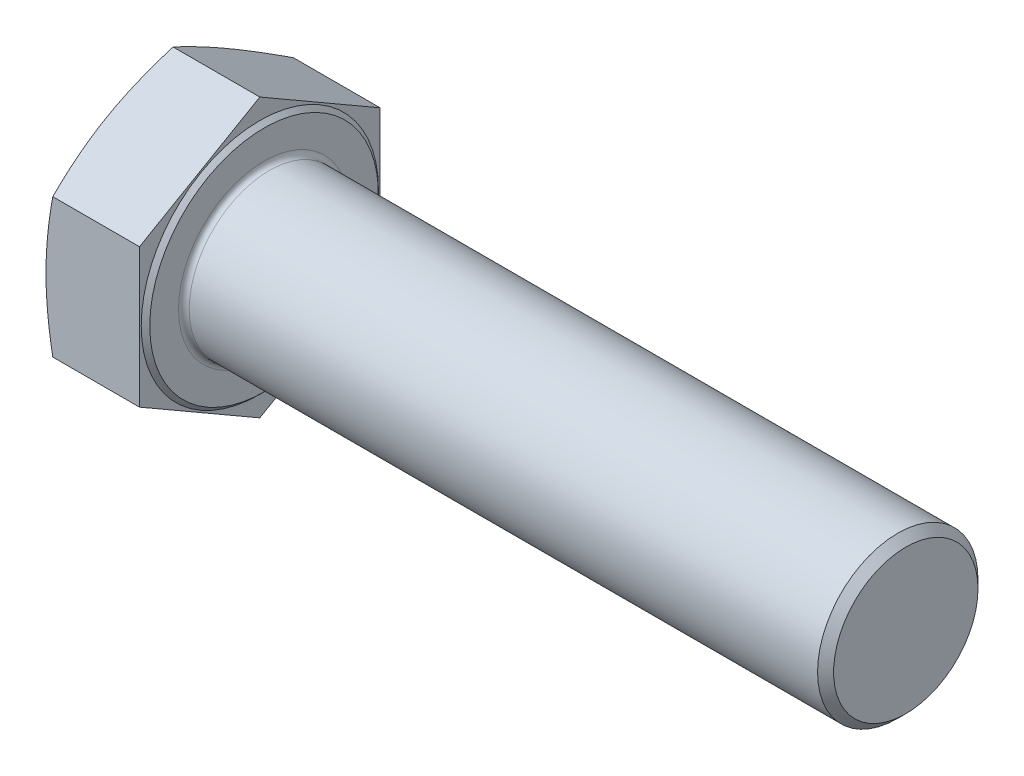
ISO-10303-21;
HEADER;
FILE_DESCRIPTION(('STEP AP214'),'2;1');
FILE_NAME('part.step','',(''),(''),'','','');
FILE_SCHEMA(('AUTOMOTIVE_DESIGN { 1 0 10303 214 1 1 1 1 }'));
ENDSEC;
DATA;
#1=APPLICATION_CONTEXT('core data for automotive mechanical design processes');
#2=APPLICATION_PROTOCOL_DEFINITION('international standard','automotive_design',2000,#1);
#3=PRODUCT_CONTEXT('',#1,'mechanical');
#4=PRODUCT('Part','Part','',(#3));
#5=PRODUCT_RELATED_PRODUCT_CATEGORY('part','',(#4));
#6=PRODUCT_DEFINITION_FORMATION('','',#4);
#7=PRODUCT_DEFINITION_CONTEXT('part definition',#1,'design');
#8=PRODUCT_DEFINITION('design','',#6,#7);
#9=PRODUCT_DEFINITION_SHAPE('','',#8);
#10=(LENGTH_UNIT() NAMED_UNIT(*) SI_UNIT(.MILLI.,.METRE.));
#11=(NAMED_UNIT(*) PLANE_ANGLE_UNIT() SI_UNIT($,.RADIAN.));
#12=(NAMED_UNIT(*) SI_UNIT($,.STERADIAN.) SOLID_ANGLE_UNIT());
#13=UNCERTAINTY_MEASURE_WITH_UNIT(LENGTH_MEASURE(1.E-05),#10,'distance_accuracy_value','');
#14=(GEOMETRIC_REPRESENTATION_CONTEXT(3) GLOBAL_UNCERTAINTY_ASSIGNED_CONTEXT((#13)) GLOBAL_UNIT_ASSIGNED_CONTEXT((#10,
#11,#12)) REPRESENTATION_CONTEXT('',''));
#15=CARTESIAN_POINT('',(0.,0.,0.));
#16=DIRECTION('',(0.,0.,1.));
#17=DIRECTION('',(1.,0.,0.));
#18=AXIS2_PLACEMENT_3D('',#15,#16,#17);
#19=CARTESIAN_POINT('',(18.28,0.,45.));
#20=DIRECTION('',(-1.,0.,0.));
#21=DIRECTION('',(0.,0.,1.));
#22=AXIS2_PLACEMENT_3D('',#19,#20,#21);
#23=PLANE('',#22);
#24=CARTESIAN_POINT('',(18.28,0.,0.));
#25=DIRECTION('',(-1.,0.,0.));
#26=DIRECTION('',(0.,0.,1.));
#27=AXIS2_PLACEMENT_3D('',#24,#25,#26);
#28=CIRCLE('',#27,16.);
#29=CARTESIAN_POINT('',(18.28,0.,16.));
#30=VERTEX_POINT('',#29);
#31=EDGE_CURVE('E11',#30,#30,#28,.T.);
#32=ORIENTED_EDGE('',*,*,#31,.T.);
#33=EDGE_LOOP('',(#32));
#34=FACE_BOUND('',#33,.T.);
#35=CARTESIAN_POINT('',(18.28,0.,0.));
#36=DIRECTION('',(-1.,0.,0.));
#37=DIRECTION('',(0.,0.,1.));
#38=AXIS2_PLACEMENT_3D('',#35,#36,#37);
#39=CIRCLE('',#38,21.375);
#40=CARTESIAN_POINT('',(18.28,0.,21.375));
#41=VERTEX_POINT('',#40);
#42=EDGE_CURVE('E265',#41,#41,#39,.T.);
#43=ORIENTED_EDGE('',*,*,#42,.F.);
#44=EDGE_LOOP('',(#43));
#45=FACE_BOUND('',#44,.T.);
#46=ADVANCED_FACE('F32',(#34,#45),#23,.F.);
#47=CARTESIAN_POINT('',(18.28,-12.9903810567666,22.5));
#48=DIRECTION('',(0.,0.866025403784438,-0.5));
#49=DIRECTION('',(0.,0.5,0.866025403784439));
#50=AXIS2_PLACEMENT_3D('',#47,#48,#49);
#51=PLANE('',#50);
#52=CARTESIAN_POINT('',(1.26693582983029,-25.980877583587,-0.000199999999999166));
#53=CARTESIAN_POINT('',(1.16902690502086,-25.7118550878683,0.46576063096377));
#54=CARTESIAN_POINT('',(1.07552121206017,-25.4424372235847,0.932406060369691));
#55=CARTESIAN_POINT('',(0.89828493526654,-24.9027740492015,1.86713009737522));
#56=CARTESIAN_POINT('',(0.814555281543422,-24.6325286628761,2.33520883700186));
#57=CARTESIAN_POINT('',(0.579402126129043,-23.8201988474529,3.74220534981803));
#58=CARTESIAN_POINT('',(0.444152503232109,-23.2768926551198,4.68323927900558));
#59=CARTESIAN_POINT('',(0.279780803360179,-22.4626151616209,6.09360926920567));
#60=CARTESIAN_POINT('',(0.231546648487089,-22.1925833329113,6.56131811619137));
#61=CARTESIAN_POINT('',(0.148249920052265,-21.6520154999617,7.49760906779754));
#62=CARTESIAN_POINT('',(0.113186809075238,-21.3814795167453,7.96619113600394));
#63=CARTESIAN_POINT('',(0.0568446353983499,-20.8401411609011,8.90381667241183));
#64=CARTESIAN_POINT('',(0.0355608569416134,-20.569338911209,9.37285992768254));
#65=CARTESIAN_POINT('',(0.00713856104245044,-20.0275483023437,10.3112687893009));
#66=CARTESIAN_POINT('',(0.,-19.7565599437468,10.7806343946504));
#67=CARTESIAN_POINT('',(0.,-19.2145832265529,11.7193656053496));
#68=CARTESIAN_POINT('',(0.0071385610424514,-18.943594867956,12.1887312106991));
#69=CARTESIAN_POINT('',(0.0355608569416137,-18.4018042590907,13.1271400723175));
#70=CARTESIAN_POINT('',(0.0568446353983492,-18.1310020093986,13.5961833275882));
#71=CARTESIAN_POINT('',(0.113186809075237,-17.5896636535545,14.5338088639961));
#72=CARTESIAN_POINT('',(0.148249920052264,-17.3191276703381,15.0023909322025));
#73=CARTESIAN_POINT('',(0.231546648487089,-16.7785598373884,15.9386818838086));
#74=CARTESIAN_POINT('',(0.279780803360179,-16.5085280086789,16.4063907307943));
#75=CARTESIAN_POINT('',(0.444152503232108,-15.6942505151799,17.8167607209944));
#76=CARTESIAN_POINT('',(0.579402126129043,-15.1509443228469,18.757794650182));
#77=CARTESIAN_POINT('',(0.814555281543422,-14.3386145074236,20.1647911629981));
#78=CARTESIAN_POINT('',(0.89828493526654,-14.0683691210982,20.6328699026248));
#79=CARTESIAN_POINT('',(1.07552121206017,-13.528705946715,21.5675939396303));
#80=CARTESIAN_POINT('',(1.16902690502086,-13.2592880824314,22.0342393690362));
#81=CARTESIAN_POINT('',(1.26693582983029,-12.9902655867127,22.5002));
#82=B_SPLINE_CURVE_WITH_KNOTS('',3,(#52,#53,#54,#55,#56,#57,#58,#59,#60,#61,#62,#63,#64,#65,#66,
#67,#68,#69,#70,#71,#72,#73,#74,#75,#76,#77,#78,#79,#80,#81),.UNSPECIFIED.,.F.,.F.,(4,2,2,2,2,2,
2,2,2,2,2,2,2,2,4),(0.,1.64059355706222,3.28134307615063,6.56511024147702,8.19162193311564,
9.81806725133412,11.4439556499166,13.0698390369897,14.6957224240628,16.3216108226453,
17.9480561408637,19.5745678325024,22.8583349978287,24.4990845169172,26.1396780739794),.UNSPECIFIED.);
#83=CARTESIAN_POINT('',(1.26689380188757,-25.9807621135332,0.));
#84=VERTEX_POINT('',#83);
#85=CARTESIAN_POINT('',(0.,-19.4855715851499,11.25));
#86=VERTEX_POINT('',#85);
#87=EDGE_CURVE('E279',#84,#86,#82,.T.);
#88=ORIENTED_EDGE('',*,*,#87,.F.);
#89=DIRECTION('',(-1.,0.,0.));
#90=VECTOR('',#89,1.);
#91=CARTESIAN_POINT('',(18.28,-25.9807621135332,0.));
#92=LINE('',#91,#90);
#93=CARTESIAN_POINT('',(17.48,-25.9807621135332,0.));
#94=VERTEX_POINT('',#93);
#95=EDGE_CURVE('E144',#94,#84,#92,.T.);
#96=ORIENTED_EDGE('',*,*,#95,.F.);
#97=DIRECTION('',(0.,-0.5,-0.866025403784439));
#98=VECTOR('',#97,1.);
#99=CARTESIAN_POINT('',(17.48,-12.9903810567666,22.5));
#100=LINE('',#99,#98);
#101=CARTESIAN_POINT('',(17.48,-12.9903810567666,22.5));
#102=VERTEX_POINT('',#101);
#103=EDGE_CURVE('E135',#102,#94,#100,.T.);
#104=ORIENTED_EDGE('',*,*,#103,.F.);
#105=DIRECTION('',(-1.,0.,0.));
#106=VECTOR('',#105,1.);
#107=CARTESIAN_POINT('',(18.28,-12.9903810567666,22.5));
#108=LINE('',#107,#106);
#109=CARTESIAN_POINT('',(1.26689380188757,-12.9903810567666,22.5));
#110=VERTEX_POINT('',#109);
#111=EDGE_CURVE('E130',#102,#110,#108,.T.);
#112=ORIENTED_EDGE('',*,*,#111,.T.);
#113=EDGE_CURVE('E124',#86,#110,#82,.T.);
#114=ORIENTED_EDGE('',*,*,#113,.F.);
#115=EDGE_LOOP('',(#88,#96,#104,#112,#114));
#116=FACE_BOUND('',#115,.T.);
#117=ADVANCED_FACE('F34',(#116),#51,.F.);
#118=CARTESIAN_POINT('',(18.28,-25.9807621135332,0.));
#119=DIRECTION('',(0.,0.866025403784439,0.5));
#120=DIRECTION('',(0.,-0.5,0.866025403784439));
#121=AXIS2_PLACEMENT_3D('',#118,#119,#120);
#122=PLANE('',#121);
#123=CARTESIAN_POINT('',(1.26693582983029,-12.9902655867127,-22.5002));
#124=CARTESIAN_POINT('',(1.16902690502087,-13.2592880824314,-22.0342393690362));
#125=CARTESIAN_POINT('',(1.07552121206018,-13.5287059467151,-21.5675939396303));
#126=CARTESIAN_POINT('',(0.898284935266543,-14.0683691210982,-20.6328699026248));
#127=CARTESIAN_POINT('',(0.814555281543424,-14.3386145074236,-20.1647911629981));
#128=CARTESIAN_POINT('',(0.579402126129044,-15.1509443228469,-18.757794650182));
#129=CARTESIAN_POINT('',(0.444152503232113,-15.6942505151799,-17.8167607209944));
#130=CARTESIAN_POINT('',(0.279780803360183,-16.5085280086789,-16.4063907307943));
#131=CARTESIAN_POINT('',(0.231546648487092,-16.7785598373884,-15.9386818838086));
#132=CARTESIAN_POINT('',(0.148249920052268,-17.3191276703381,-15.0023909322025));
#133=CARTESIAN_POINT('',(0.113186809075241,-17.5896636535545,-14.5338088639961));
#134=CARTESIAN_POINT('',(0.0568446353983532,-18.1310020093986,-13.5961833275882));
#135=CARTESIAN_POINT('',(0.0355608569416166,-18.4018042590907,-13.1271400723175));
#136=CARTESIAN_POINT('',(0.00713856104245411,-18.943594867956,-12.1887312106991));
#137=CARTESIAN_POINT('',(0.,-19.2145832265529,-11.7193656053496));
#138=CARTESIAN_POINT('',(0.,-19.7565599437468,-10.7806343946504));
#139=CARTESIAN_POINT('',(0.00713856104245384,-20.0275483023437,-10.3112687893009));
#140=CARTESIAN_POINT('',(0.0355608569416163,-20.569338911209,-9.37285992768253));
#141=CARTESIAN_POINT('',(0.056844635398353,-20.8401411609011,-8.90381667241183));
#142=CARTESIAN_POINT('',(0.11318680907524,-21.3814795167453,-7.96619113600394));
#143=CARTESIAN_POINT('',(0.148249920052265,-21.6520154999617,-7.49760906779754));
#144=CARTESIAN_POINT('',(0.231546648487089,-22.1925833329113,-6.56131811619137));
#145=CARTESIAN_POINT('',(0.279780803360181,-22.4626151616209,-6.09360926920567));
#146=CARTESIAN_POINT('',(0.444152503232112,-23.2768926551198,-4.68323927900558));
#147=CARTESIAN_POINT('',(0.579402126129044,-23.8201988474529,-3.74220534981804));
#148=CARTESIAN_POINT('',(0.814555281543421,-24.6325286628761,-2.33520883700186));
#149=CARTESIAN_POINT('',(0.89828493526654,-24.9027740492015,-1.86713009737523));
#150=CARTESIAN_POINT('',(1.07552121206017,-25.4424372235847,-0.932406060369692));
#151=CARTESIAN_POINT('',(1.16902690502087,-25.7118550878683,-0.465760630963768));
#152=CARTESIAN_POINT('',(1.26693582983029,-25.980877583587,0.000200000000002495));
#153=B_SPLINE_CURVE_WITH_KNOTS('',3,(#123,#124,#125,#126,#127,#128,#129,#130,#131,#132,#133,
#134,#135,#136,#137,#138,#139,#140,#141,#142,#143,#144,#145,#146,#147,#148,#149,#150,#151,#152),
.UNSPECIFIED.,.F.,.F.,(4,2,2,2,2,2,2,2,2,2,2,2,2,2,4),(0.,1.64059355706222,3.28134307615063,
6.56511024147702,8.19162193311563,9.81806725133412,11.4439556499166,13.0698390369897,
14.6957224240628,16.3216108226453,17.9480561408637,19.5745678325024,22.8583349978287,
24.4990845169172,26.1396780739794),.UNSPECIFIED.);
#154=CARTESIAN_POINT('',(1.26689380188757,-12.9903810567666,-22.5));
#155=VERTEX_POINT('',#154);
#156=CARTESIAN_POINT('',(0.,-19.4855715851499,-11.25));
#157=VERTEX_POINT('',#156);
#158=EDGE_CURVE('E231',#155,#157,#153,.T.);
#159=ORIENTED_EDGE('',*,*,#158,.F.);
#160=DIRECTION('',(-1.,0.,0.));
#161=VECTOR('',#160,1.);
#162=CARTESIAN_POINT('',(18.28,-12.9903810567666,-22.5));
#163=LINE('',#162,#161);
#164=CARTESIAN_POINT('',(17.48,-12.9903810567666,-22.5));
#165=VERTEX_POINT('',#164);
#166=EDGE_CURVE('E141',#165,#155,#163,.T.);
#167=ORIENTED_EDGE('',*,*,#166,.F.);
#168=DIRECTION('',(0.,0.5,-0.866025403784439));
#169=VECTOR('',#168,1.);
#170=CARTESIAN_POINT('',(17.48,-25.9807621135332,0.));
#171=LINE('',#170,#169);
#172=EDGE_CURVE('E269',#94,#165,#171,.T.);
#173=ORIENTED_EDGE('',*,*,#172,.F.);
#174=ORIENTED_EDGE('',*,*,#95,.T.);
#175=EDGE_CURVE('E227',#157,#84,#153,.T.);
#176=ORIENTED_EDGE('',*,*,#175,.F.);
#177=EDGE_LOOP('',(#159,#167,#173,#174,#176));
#178=FACE_BOUND('',#177,.T.);
#179=ADVANCED_FACE('F180',(#178),#122,.F.);
#180=CARTESIAN_POINT('',(18.28,-12.9903810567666,-22.5));
#181=DIRECTION('',(0.,0.,1.));
#182=DIRECTION('',(1.,0.,0.));
#183=AXIS2_PLACEMENT_3D('',#180,#181,#182);
#184=PLANE('',#183);
#185=CARTESIAN_POINT('',(6.76977805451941,-34.3939613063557,-22.5));
#186=CARTESIAN_POINT('',(6.61475269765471,-33.8849780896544,-22.5));
#187=CARTESIAN_POINT('',(6.46066486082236,-33.3757094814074,-22.5));
#188=CARTESIAN_POINT('',(6.15457411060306,-32.3565430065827,-22.5));
#189=CARTESIAN_POINT('',(6.00257120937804,-31.8466451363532,-22.5));
#190=CARTESIAN_POINT('',(5.5499851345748,-30.3158533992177,-22.5));
#191=CARTESIAN_POINT('',(5.2528475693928,-29.2939366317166,-22.5));
#192=CARTESIAN_POINT('',(4.66933339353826,-27.244966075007,-22.5));
#193=CARTESIAN_POINT('',(4.38297789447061,-26.2179062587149,-22.5));
#194=CARTESIAN_POINT('',(3.82435576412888,-24.1599665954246,-22.5));
#195=CARTESIAN_POINT('',(3.55208887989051,-23.1290868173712,-22.5));
#196=CARTESIAN_POINT('',(3.02838958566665,-21.075558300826,-22.5));
#197=CARTESIAN_POINT('',(2.77674168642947,-20.0529647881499,-22.5));
#198=CARTESIAN_POINT('',(2.29487034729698,-18.0026892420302,-22.5));
#199=CARTESIAN_POINT('',(2.06464726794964,-16.9750071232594,-22.5));
#200=CARTESIAN_POINT('',(1.63099346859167,-14.9143243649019,-22.5));
#201=CARTESIAN_POINT('',(1.4275536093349,-13.8813256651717,-22.5));
#202=CARTESIAN_POINT('',(1.05366080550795,-11.8093309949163,-22.5));
#203=CARTESIAN_POINT('',(0.883206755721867,-10.7703352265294,-22.5));
#204=CARTESIAN_POINT('',(0.599087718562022,-8.80334142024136,-22.5));
#205=CARTESIAN_POINT('',(0.481198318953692,-7.87595930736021,-22.5));
#206=CARTESIAN_POINT('',(0.281639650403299,-6.01727365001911,-22.5));
#207=CARTESIAN_POINT('',(0.199969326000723,-5.0859702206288,-22.5));
#208=CARTESIAN_POINT('',(0.0767818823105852,-3.22133095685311,-22.5));
#209=CARTESIAN_POINT('',(0.0352363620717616,-2.28799702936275,-22.5));
#210=CARTESIAN_POINT('',(-0.00559802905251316,-0.420395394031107,-22.5));
#211=CARTESIAN_POINT('',(-0.00488719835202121,0.513872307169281,-22.5));
#212=CARTESIAN_POINT('',(0.0388631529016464,2.38614034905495,-22.5));
#213=CARTESIAN_POINT('',(0.0821173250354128,3.32413559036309,-22.5));
#214=CARTESIAN_POINT('',(0.208963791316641,5.19737094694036,-22.5));
#215=CARTESIAN_POINT('',(0.292557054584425,6.13261099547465,-22.5));
#216=CARTESIAN_POINT('',(0.496171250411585,7.99987415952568,-22.5));
#217=CARTESIAN_POINT('',(0.616223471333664,8.93189381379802,-22.5));
#218=CARTESIAN_POINT('',(0.887885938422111,10.791270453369,-22.5));
#219=CARTESIAN_POINT('',(1.03949635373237,11.7186274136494,-22.5));
#220=CARTESIAN_POINT('',(1.37806511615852,13.6174776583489,-22.5));
#221=CARTESIAN_POINT('',(1.56646900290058,14.5887109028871,-22.5));
#222=CARTESIAN_POINT('',(1.96752546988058,16.5261898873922,-22.5));
#223=CARTESIAN_POINT('',(2.18017987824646,17.4924352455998,-22.5));
#224=CARTESIAN_POINT('',(2.62527208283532,19.42062699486,-22.5));
#225=CARTESIAN_POINT('',(2.85771562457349,20.3825720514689,-22.5));
#226=CARTESIAN_POINT('',(3.33860492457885,22.3024099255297,-22.5));
#227=CARTESIAN_POINT('',(3.58705029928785,23.2603028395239,-22.5));
#228=CARTESIAN_POINT('',(4.09727957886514,25.1738346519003,-22.5));
#229=CARTESIAN_POINT('',(4.35908020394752,26.1294690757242,-22.5));
#230=CARTESIAN_POINT('',(4.89333122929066,28.0377523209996,-22.5));
#231=CARTESIAN_POINT('',(5.16578167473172,28.9904011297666,-22.5));
#232=CARTESIAN_POINT('',(5.71938307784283,30.8929884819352,-22.5));
#233=CARTESIAN_POINT('',(6.00053256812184,31.8429274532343,-22.5));
#234=CARTESIAN_POINT('',(6.57006413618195,33.7406289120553,-22.5));
#235=CARTESIAN_POINT('',(6.85844619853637,34.688391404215,-22.5));
#236=CARTESIAN_POINT('',(7.4380210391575,36.5716051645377,-22.5));
#237=CARTESIAN_POINT('',(7.729147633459,37.5070768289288,-22.5));
#238=CARTESIAN_POINT('',(8.31635992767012,39.3764609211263,-22.5));
#239=CARTESIAN_POINT('',(8.61244562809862,40.3103733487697,-22.5));
#240=CARTESIAN_POINT('',(9.20883136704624,42.1768976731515,-22.5));
#241=CARTESIAN_POINT('',(9.50913159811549,43.1095095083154,-22.5));
#242=CARTESIAN_POINT('',(10.1133153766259,44.9735719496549,-22.5));
#243=CARTESIAN_POINT('',(10.4171989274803,45.9050225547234,-22.5));
#244=CARTESIAN_POINT('',(11.0268823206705,47.763380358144,-22.5));
#245=CARTESIAN_POINT('',(11.3326705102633,48.6902913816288,-22.5));
#246=CARTESIAN_POINT('',(11.9468856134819,50.5432389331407,-22.5));
#247=CARTESIAN_POINT('',(12.2553125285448,51.4692754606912,-22.5));
#248=CARTESIAN_POINT('',(12.8744319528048,53.3205062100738,-22.5));
#249=CARTESIAN_POINT('',(13.185124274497,54.2457004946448,-22.5));
#250=CARTESIAN_POINT('',(13.8085193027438,56.0954091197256,-22.5));
#251=CARTESIAN_POINT('',(14.121222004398,57.0199234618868,-22.5));
#252=CARTESIAN_POINT('',(14.4347905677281,57.9441433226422,-22.5));
#253=B_SPLINE_CURVE_WITH_KNOTS('',3,(#185,#186,#187,#188,#189,#190,#191,#192,#193,#194,#195,
#196,#197,#198,#199,#200,#201,#202,#203,#204,#205,#206,#207,#208,#209,#210,#211,#212,#213,#214,
#215,#216,#217,#218,#219,#220,#221,#222,#223,#224,#225,#226,#227,#228,#229,#230,#231,#232,#233,
#234,#235,#236,#237,#238,#239,#240,#241,#242,#243,#244,#245,#246,#247,#248,#249,#250,#251,#252),
.UNSPECIFIED.,.F.,.F.,(4,2,2,2,2,2,2,2,2,2,2,2,2,2,2,2,2,2,2,2,2,2,2,2,2,2,2,2,2,2,2,2,2,4),(0.,
1.59620348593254,3.19241627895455,6.38507782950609,9.58369609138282,12.7822569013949,
15.9413811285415,19.100558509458,22.2586550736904,25.4166458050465,28.2205656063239,
31.02440369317,33.8262557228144,36.6280879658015,39.444129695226,42.2602390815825,
45.0787720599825,47.8973201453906,50.8649551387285,53.8328139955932,56.8015374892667,
59.7701898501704,62.7426546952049,65.7151321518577,68.6871109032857,71.6590833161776,
74.5982434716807,77.5374039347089,80.4766991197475,83.4159971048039,86.3441377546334,
89.2722799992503,92.2001825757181,95.1280780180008),.UNSPECIFIED.);
#254=CARTESIAN_POINT('',(1.26689380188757,12.9903810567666,-22.5));
#255=VERTEX_POINT('',#254);
#256=CARTESIAN_POINT('',(0.,0.,-22.5));
#257=VERTEX_POINT('',#256);
#258=EDGE_CURVE('E304',#255,#257,#253,.F.);
#259=ORIENTED_EDGE('',*,*,#258,.F.);
#260=DIRECTION('',(-1.,0.,0.));
#261=VECTOR('',#260,1.);
#262=CARTESIAN_POINT('',(18.28,12.9903810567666,-22.5));
#263=LINE('',#262,#261);
#264=CARTESIAN_POINT('',(17.48,12.9903810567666,-22.5));
#265=VERTEX_POINT('',#264);
#266=EDGE_CURVE('E132',#265,#255,#263,.T.);
#267=ORIENTED_EDGE('',*,*,#266,.F.);
#268=DIRECTION('',(0.,1.,0.));
#269=VECTOR('',#268,1.);
#270=CARTESIAN_POINT('',(17.48,-12.9903810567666,-22.5));
#271=LINE('',#270,#269);
#272=EDGE_CURVE('E262',#165,#265,#271,.T.);
#273=ORIENTED_EDGE('',*,*,#272,.F.);
#274=ORIENTED_EDGE('',*,*,#166,.T.);
#275=EDGE_CURVE('E232',#257,#155,#253,.F.);
#276=ORIENTED_EDGE('',*,*,#275,.F.);
#277=EDGE_LOOP('',(#259,#267,#273,#274,#276));
#278=FACE_BOUND('',#277,.T.);
#279=ADVANCED_FACE('F240',(#278),#184,.F.);
#280=CARTESIAN_POINT('',(18.28,12.9903810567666,-22.5));
#281=DIRECTION('',(0.,-0.866025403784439,0.5));
#282=DIRECTION('',(0.,-0.5,-0.866025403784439));
#283=AXIS2_PLACEMENT_3D('',#280,#281,#282);
#284=PLANE('',#283);
#285=CARTESIAN_POINT('',(1.2669358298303,25.980877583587,0.000200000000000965));
#286=CARTESIAN_POINT('',(1.16902690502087,25.7118550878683,-0.465760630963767));
#287=CARTESIAN_POINT('',(1.07552121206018,25.4424372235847,-0.93240606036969));
#288=CARTESIAN_POINT('',(0.898284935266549,24.9027740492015,-1.86713009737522));
#289=CARTESIAN_POINT('',(0.814555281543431,24.6325286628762,-2.33520883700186));
#290=CARTESIAN_POINT('',(0.579402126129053,23.8201988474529,-3.74220534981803));
#291=CARTESIAN_POINT('',(0.44415250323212,23.2768926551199,-4.68323927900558));
#292=CARTESIAN_POINT('',(0.279780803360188,22.4626151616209,-6.09360926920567));
#293=CARTESIAN_POINT('',(0.231546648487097,22.1925833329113,-6.56131811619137));
#294=CARTESIAN_POINT('',(0.148249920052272,21.6520154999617,-7.49760906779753));
#295=CARTESIAN_POINT('',(0.113186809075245,21.3814795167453,-7.96619113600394));
#296=CARTESIAN_POINT('',(0.0568446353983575,20.8401411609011,-8.90381667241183));
#297=CARTESIAN_POINT('',(0.0355608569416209,20.569338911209,-9.37285992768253));
#298=CARTESIAN_POINT('',(0.00713856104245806,20.0275483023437,-10.3112687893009));
#299=CARTESIAN_POINT('',(0.,19.7565599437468,-10.7806343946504));
#300=CARTESIAN_POINT('',(0.,19.214583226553,-11.7193656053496));
#301=CARTESIAN_POINT('',(0.00713856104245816,18.943594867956,-12.1887312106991));
#302=CARTESIAN_POINT('',(0.0355608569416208,18.4018042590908,-13.1271400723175));
#303=CARTESIAN_POINT('',(0.056844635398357,18.1310020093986,-13.5961833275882));
#304=CARTESIAN_POINT('',(0.113186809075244,17.5896636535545,-14.5338088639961));
#305=CARTESIAN_POINT('',(0.14824992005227,17.3191276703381,-15.0023909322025));
#306=CARTESIAN_POINT('',(0.231546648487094,16.7785598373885,-15.9386818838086));
#307=CARTESIAN_POINT('',(0.279780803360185,16.5085280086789,-16.4063907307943));
#308=CARTESIAN_POINT('',(0.444152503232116,15.6942505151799,-17.8167607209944));
#309=CARTESIAN_POINT('',(0.579402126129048,15.1509443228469,-18.757794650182));
#310=CARTESIAN_POINT('',(0.814555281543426,14.3386145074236,-20.1647911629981));
#311=CARTESIAN_POINT('',(0.898284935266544,14.0683691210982,-20.6328699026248));
#312=CARTESIAN_POINT('',(1.07552121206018,13.5287059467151,-21.5675939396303));
#313=CARTESIAN_POINT('',(1.16902690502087,13.2592880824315,-22.0342393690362));
#314=CARTESIAN_POINT('',(1.26693582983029,12.9902655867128,-22.5002));
#315=B_SPLINE_CURVE_WITH_KNOTS('',3,(#285,#286,#287,#288,#289,#290,#291,#292,#293,#294,#295,
#296,#297,#298,#299,#300,#301,#302,#303,#304,#305,#306,#307,#308,#309,#310,#311,#312,#313,#314),
.UNSPECIFIED.,.F.,.F.,(4,2,2,2,2,2,2,2,2,2,2,2,2,2,4),(0.,1.64059355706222,3.28134307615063,
6.56511024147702,8.19162193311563,9.81806725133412,11.4439556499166,13.0698390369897,
14.6957224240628,16.3216108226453,17.9480561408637,19.5745678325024,22.8583349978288,
24.4990845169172,26.1396780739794),.UNSPECIFIED.);
#316=CARTESIAN_POINT('',(1.26689380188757,25.9807621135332,0.));
#317=VERTEX_POINT('',#316);
#318=CARTESIAN_POINT('',(0.,19.4855715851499,-11.25));
#319=VERTEX_POINT('',#318);
#320=EDGE_CURVE('E222',#317,#319,#315,.T.);
#321=ORIENTED_EDGE('',*,*,#320,.F.);
#322=DIRECTION('',(-1.,0.,0.));
#323=VECTOR('',#322,1.);
#324=CARTESIAN_POINT('',(18.28,25.9807621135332,0.));
#325=LINE('',#324,#323);
#326=CARTESIAN_POINT('',(17.48,25.9807621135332,0.));
#327=VERTEX_POINT('',#326);
#328=EDGE_CURVE('E129',#327,#317,#325,.T.);
#329=ORIENTED_EDGE('',*,*,#328,.F.);
#330=DIRECTION('',(0.,0.5,0.866025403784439));
#331=VECTOR('',#330,1.);
#332=CARTESIAN_POINT('',(17.48,12.9903810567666,-22.5));
#333=LINE('',#332,#331);
#334=EDGE_CURVE('E259',#265,#327,#333,.T.);
#335=ORIENTED_EDGE('',*,*,#334,.F.);
#336=ORIENTED_EDGE('',*,*,#266,.T.);
#337=EDGE_CURVE('E256',#319,#255,#315,.T.);
#338=ORIENTED_EDGE('',*,*,#337,.F.);
#339=EDGE_LOOP('',(#321,#329,#335,#336,#338));
#340=FACE_BOUND('',#339,.T.);
#341=ADVANCED_FACE('F244',(#340),#284,.F.);
#342=CARTESIAN_POINT('',(18.28,25.9807621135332,0.));
#343=DIRECTION('',(0.,-0.866025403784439,-0.5));
#344=DIRECTION('',(0.,0.5,-0.866025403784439));
#345=AXIS2_PLACEMENT_3D('',#342,#343,#344);
#346=PLANE('',#345);
#347=CARTESIAN_POINT('',(1.26693582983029,12.9902655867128,22.5002));
#348=CARTESIAN_POINT('',(1.16902690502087,13.2592880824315,22.0342393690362));
#349=CARTESIAN_POINT('',(1.07552121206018,13.5287059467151,21.5675939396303));
#350=CARTESIAN_POINT('',(0.898284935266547,14.0683691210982,20.6328699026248));
#351=CARTESIAN_POINT('',(0.814555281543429,14.3386145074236,20.1647911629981));
#352=CARTESIAN_POINT('',(0.57940212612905,15.1509443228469,18.757794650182));
#353=CARTESIAN_POINT('',(0.444152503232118,15.6942505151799,17.8167607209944));
#354=CARTESIAN_POINT('',(0.279780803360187,16.5085280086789,16.4063907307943));
#355=CARTESIAN_POINT('',(0.231546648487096,16.7785598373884,15.9386818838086));
#356=CARTESIAN_POINT('',(0.148249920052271,17.3191276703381,15.0023909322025));
#357=CARTESIAN_POINT('',(0.113186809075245,17.5896636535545,14.5338088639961));
#358=CARTESIAN_POINT('',(0.0568446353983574,18.1310020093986,13.5961833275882));
#359=CARTESIAN_POINT('',(0.035560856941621,18.4018042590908,13.1271400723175));
#360=CARTESIAN_POINT('',(0.00713856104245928,18.943594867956,12.1887312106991));
#361=CARTESIAN_POINT('',(0.,19.214583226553,11.7193656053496));
#362=CARTESIAN_POINT('',(0.,19.7565599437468,10.7806343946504));
#363=CARTESIAN_POINT('',(0.00713856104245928,20.0275483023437,10.3112687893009));
#364=CARTESIAN_POINT('',(0.0355608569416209,20.569338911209,9.37285992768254));
#365=CARTESIAN_POINT('',(0.0568446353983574,20.8401411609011,8.90381667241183));
#366=CARTESIAN_POINT('',(0.113186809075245,21.3814795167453,7.96619113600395));
#367=CARTESIAN_POINT('',(0.148249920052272,21.6520154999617,7.49760906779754));
#368=CARTESIAN_POINT('',(0.231546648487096,22.1925833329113,6.56131811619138));
#369=CARTESIAN_POINT('',(0.279780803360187,22.4626151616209,6.09360926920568));
#370=CARTESIAN_POINT('',(0.444152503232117,23.2768926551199,4.68323927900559));
#371=CARTESIAN_POINT('',(0.57940212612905,23.8201988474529,3.74220534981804));
#372=CARTESIAN_POINT('',(0.814555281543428,24.6325286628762,2.33520883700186));
#373=CARTESIAN_POINT('',(0.898284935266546,24.9027740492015,1.86713009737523));
#374=CARTESIAN_POINT('',(1.07552121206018,25.4424372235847,0.932406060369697));
#375=CARTESIAN_POINT('',(1.16902690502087,25.7118550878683,0.465760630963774));
#376=CARTESIAN_POINT('',(1.2669358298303,25.980877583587,-0.000199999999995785));
#377=B_SPLINE_CURVE_WITH_KNOTS('',3,(#347,#348,#349,#350,#351,#352,#353,#354,#355,#356,#357,
#358,#359,#360,#361,#362,#363,#364,#365,#366,#367,#368,#369,#370,#371,#372,#373,#374,#375,#376),
.UNSPECIFIED.,.F.,.F.,(4,2,2,2,2,2,2,2,2,2,2,2,2,2,4),(0.,1.64059355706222,3.28134307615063,
6.56511024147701,8.19162193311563,9.81806725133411,11.4439556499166,13.0698390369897,
14.6957224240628,16.3216108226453,17.9480561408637,19.5745678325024,22.8583349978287,
24.4990845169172,26.1396780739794),.UNSPECIFIED.);
#378=CARTESIAN_POINT('',(1.26689380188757,12.9903810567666,22.5));
#379=VERTEX_POINT('',#378);
#380=CARTESIAN_POINT('',(0.,19.4855715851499,11.25));
#381=VERTEX_POINT('',#380);
#382=EDGE_CURVE('E109',#379,#381,#377,.T.);
#383=ORIENTED_EDGE('',*,*,#382,.F.);
#384=DIRECTION('',(-1.,0.,0.));
#385=VECTOR('',#384,1.);
#386=CARTESIAN_POINT('',(18.28,12.9903810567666,22.5));
#387=LINE('',#386,#385);
#388=CARTESIAN_POINT('',(17.48,12.9903810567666,22.5));
#389=VERTEX_POINT('',#388);
#390=EDGE_CURVE('E121',#389,#379,#387,.T.);
#391=ORIENTED_EDGE('',*,*,#390,.F.);
#392=DIRECTION('',(0.,-0.5,0.866025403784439));
#393=VECTOR('',#392,1.);
#394=CARTESIAN_POINT('',(17.48,25.9807621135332,0.));
#395=LINE('',#394,#393);
#396=EDGE_CURVE('E56',#327,#389,#395,.T.);
#397=ORIENTED_EDGE('',*,*,#396,.F.);
#398=ORIENTED_EDGE('',*,*,#328,.T.);
#399=EDGE_CURVE('E123',#381,#317,#377,.T.);
#400=ORIENTED_EDGE('',*,*,#399,.F.);
#401=EDGE_LOOP('',(#383,#391,#397,#398,#400));
#402=FACE_BOUND('',#401,.T.);
#403=ADVANCED_FACE('F120',(#402),#346,.F.);
#404=CARTESIAN_POINT('',(18.28,12.9903810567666,22.5));
#405=DIRECTION('',(0.,0.,-1.));
#406=DIRECTION('',(0.,1.,0.));
#407=AXIS2_PLACEMENT_3D('',#404,#405,#406);
#408=PLANE('',#407);
#409=CARTESIAN_POINT('',(6.76977805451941,-34.3939613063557,22.5));
#410=CARTESIAN_POINT('',(6.61475269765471,-33.8849780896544,22.5));
#411=CARTESIAN_POINT('',(6.46066486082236,-33.3757094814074,22.5));
#412=CARTESIAN_POINT('',(6.15457411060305,-32.3565430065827,22.5));
#413=CARTESIAN_POINT('',(6.00257120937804,-31.8466451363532,22.5));
#414=CARTESIAN_POINT('',(5.5499851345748,-30.3158533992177,22.5));
#415=CARTESIAN_POINT('',(5.25284756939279,-29.2939366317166,22.5));
#416=CARTESIAN_POINT('',(4.66933339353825,-27.2449660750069,22.5));
#417=CARTESIAN_POINT('',(4.3829778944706,-26.2179062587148,22.5));
#418=CARTESIAN_POINT('',(3.82435576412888,-24.1599665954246,22.5));
#419=CARTESIAN_POINT('',(3.55208887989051,-23.1290868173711,22.5));
#420=CARTESIAN_POINT('',(3.02838958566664,-21.075558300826,22.5));
#421=CARTESIAN_POINT('',(2.77674168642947,-20.0529647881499,22.5));
#422=CARTESIAN_POINT('',(2.29487034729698,-18.0026892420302,22.5));
#423=CARTESIAN_POINT('',(2.06464726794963,-16.9750071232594,22.5));
#424=CARTESIAN_POINT('',(1.63099346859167,-14.9143243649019,22.5));
#425=CARTESIAN_POINT('',(1.4275536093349,-13.8813256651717,22.5));
#426=CARTESIAN_POINT('',(1.05366080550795,-11.8093309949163,22.5));
#427=CARTESIAN_POINT('',(0.883206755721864,-10.7703352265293,22.5));
#428=CARTESIAN_POINT('',(0.59908771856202,-8.80334142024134,22.5));
#429=CARTESIAN_POINT('',(0.48119831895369,-7.8759593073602,22.5));
#430=CARTESIAN_POINT('',(0.281639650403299,-6.0172736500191,22.5));
#431=CARTESIAN_POINT('',(0.199969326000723,-5.08597022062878,22.5));
#432=CARTESIAN_POINT('',(0.0767818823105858,-3.2213309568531,22.5));
#433=CARTESIAN_POINT('',(0.0352363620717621,-2.28799702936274,22.5));
#434=CARTESIAN_POINT('',(-0.0055980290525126,-0.420395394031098,22.5));
#435=CARTESIAN_POINT('',(-0.00488719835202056,0.513872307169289,22.5));
#436=CARTESIAN_POINT('',(0.0388631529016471,2.38614034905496,22.5));
#437=CARTESIAN_POINT('',(0.0821173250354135,3.32413559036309,22.5));
#438=CARTESIAN_POINT('',(0.208963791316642,5.19737094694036,22.5));
#439=CARTESIAN_POINT('',(0.292557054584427,6.13261099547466,22.5));
#440=CARTESIAN_POINT('',(0.496171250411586,7.99987415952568,22.5));
#441=CARTESIAN_POINT('',(0.616223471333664,8.93189381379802,22.5));
#442=CARTESIAN_POINT('',(0.887885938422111,10.791270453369,22.5));
#443=CARTESIAN_POINT('',(1.03949635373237,11.7186274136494,22.5));
#444=CARTESIAN_POINT('',(1.37806511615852,13.6174776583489,22.5));
#445=CARTESIAN_POINT('',(1.56646900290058,14.5887109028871,22.5));
#446=CARTESIAN_POINT('',(1.96752546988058,16.5261898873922,22.5));
#447=CARTESIAN_POINT('',(2.18017987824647,17.4924352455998,22.5));
#448=CARTESIAN_POINT('',(2.62527208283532,19.42062699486,22.5));
#449=CARTESIAN_POINT('',(2.8577156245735,20.3825720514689,22.5));
#450=CARTESIAN_POINT('',(3.33860492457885,22.3024099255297,22.5));
#451=CARTESIAN_POINT('',(3.58705029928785,23.2603028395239,22.5));
#452=CARTESIAN_POINT('',(4.09727957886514,25.1738346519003,22.5));
#453=CARTESIAN_POINT('',(4.35908020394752,26.1294690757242,22.5));
#454=CARTESIAN_POINT('',(4.89333122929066,28.0377523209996,22.5));
#455=CARTESIAN_POINT('',(5.16578167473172,28.9904011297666,22.5));
#456=CARTESIAN_POINT('',(5.71938307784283,30.8929884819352,22.5));
#457=CARTESIAN_POINT('',(6.00053256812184,31.8429274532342,22.5));
#458=CARTESIAN_POINT('',(6.57006413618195,33.7406289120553,22.5));
#459=CARTESIAN_POINT('',(6.85844619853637,34.688391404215,22.5));
#460=CARTESIAN_POINT('',(7.4380210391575,36.5716051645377,22.5));
#461=CARTESIAN_POINT('',(7.729147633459,37.5070768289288,22.5));
#462=CARTESIAN_POINT('',(8.31635992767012,39.3764609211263,22.5));
#463=CARTESIAN_POINT('',(8.61244562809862,40.3103733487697,22.5));
#464=CARTESIAN_POINT('',(9.20883136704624,42.1768976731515,22.5));
#465=CARTESIAN_POINT('',(9.50913159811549,43.1095095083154,22.5));
#466=CARTESIAN_POINT('',(10.1133153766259,44.9735719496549,22.5));
#467=CARTESIAN_POINT('',(10.4171989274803,45.9050225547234,22.5));
#468=CARTESIAN_POINT('',(11.0268823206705,47.763380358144,22.5));
#469=CARTESIAN_POINT('',(11.3326705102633,48.6902913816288,22.5));
#470=CARTESIAN_POINT('',(11.9468856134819,50.5432389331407,22.5));
#471=CARTESIAN_POINT('',(12.2553125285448,51.4692754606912,22.5));
#472=CARTESIAN_POINT('',(12.8744319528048,53.3205062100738,22.5));
#473=CARTESIAN_POINT('',(13.185124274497,54.2457004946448,22.5));
#474=CARTESIAN_POINT('',(13.8085193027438,56.0954091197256,22.5));
#475=CARTESIAN_POINT('',(14.121222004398,57.0199234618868,22.5));
#476=CARTESIAN_POINT('',(14.4347905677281,57.9441433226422,22.5));
#477=B_SPLINE_CURVE_WITH_KNOTS('',3,(#409,#410,#411,#412,#413,#414,#415,#416,#417,#418,#419,
#420,#421,#422,#423,#424,#425,#426,#427,#428,#429,#430,#431,#432,#433,#434,#435,#436,#437,#438,
#439,#440,#441,#442,#443,#444,#445,#446,#447,#448,#449,#450,#451,#452,#453,#454,#455,#456,#457,
#458,#459,#460,#461,#462,#463,#464,#465,#466,#467,#468,#469,#470,#471,#472,#473,#474,#475,#476),
.UNSPECIFIED.,.F.,.F.,(4,2,2,2,2,2,2,2,2,2,2,2,2,2,2,2,2,2,2,2,2,2,2,2,2,2,2,2,2,2,2,2,2,4),(0.,
1.59620348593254,3.19241627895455,6.3850778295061,9.58369609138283,12.7822569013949,
15.9413811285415,19.100558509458,22.2586550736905,25.4166458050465,28.2205656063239,
31.02440369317,33.8262557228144,36.6280879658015,39.444129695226,42.2602390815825,
45.0787720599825,47.8973201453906,50.8649551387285,53.8328139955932,56.8015374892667,
59.7701898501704,62.7426546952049,65.7151321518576,68.6871109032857,71.6590833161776,
74.5982434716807,77.5374039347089,80.4766991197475,83.4159971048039,86.3441377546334,
89.2722799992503,92.2001825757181,95.1280780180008),.UNSPECIFIED.);
#478=CARTESIAN_POINT('',(0.,0.,22.5));
#479=VERTEX_POINT('',#478);
#480=EDGE_CURVE('E115',#110,#479,#477,.T.);
#481=ORIENTED_EDGE('',*,*,#480,.F.);
#482=ORIENTED_EDGE('',*,*,#111,.F.);
#483=DIRECTION('',(0.,-1.,0.));
#484=VECTOR('',#483,1.);
#485=CARTESIAN_POINT('',(17.48,12.9903810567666,22.5));
#486=LINE('',#485,#484);
#487=EDGE_CURVE('E128',#389,#102,#486,.T.);
#488=ORIENTED_EDGE('',*,*,#487,.F.);
#489=ORIENTED_EDGE('',*,*,#390,.T.);
#490=EDGE_CURVE('E106',#479,#379,#477,.T.);
#491=ORIENTED_EDGE('',*,*,#490,.F.);
#492=EDGE_LOOP('',(#481,#482,#488,#489,#491));
#493=FACE_BOUND('',#492,.T.);
#494=ADVANCED_FACE('F126',(#493),#408,.F.);
#495=CARTESIAN_POINT('',(17.48,22.175,0.));
#496=DIRECTION('',(1.,0.,0.));
#497=DIRECTION('',(0.,0.,-1.));
#498=AXIS2_PLACEMENT_3D('',#495,#496,#497);
#499=PLANE('',#498);
#500=CARTESIAN_POINT('',(17.48,0.,0.));
#501=DIRECTION('',(-1.,0.,0.));
#502=DIRECTION('',(0.,0.,1.));
#503=AXIS2_PLACEMENT_3D('',#500,#501,#502);
#504=CIRCLE('',#503,22.175);
#505=CARTESIAN_POINT('',(17.48,0.,22.175));
#506=VERTEX_POINT('',#505);
#507=EDGE_CURVE('E260',#506,#506,#504,.T.);
#508=ORIENTED_EDGE('',*,*,#507,.T.);
#509=EDGE_LOOP('',(#508));
#510=FACE_BOUND('',#509,.T.);
#511=ORIENTED_EDGE('',*,*,#103,.T.);
#512=ORIENTED_EDGE('',*,*,#172,.T.);
#513=ORIENTED_EDGE('',*,*,#272,.T.);
#514=ORIENTED_EDGE('',*,*,#334,.T.);
#515=ORIENTED_EDGE('',*,*,#396,.T.);
#516=ORIENTED_EDGE('',*,*,#487,.T.);
#517=EDGE_LOOP('',(#511,#512,#513,#514,#515,#516));
#518=FACE_BOUND('',#517,.T.);
#519=ADVANCED_FACE('F190',(#510,#518),#499,.T.);
#520=CARTESIAN_POINT('',(17.48,0.,0.));
#521=DIRECTION('',(-1.,0.,0.));
#522=DIRECTION('',(0.,0.,1.));
#523=AXIS2_PLACEMENT_3D('',#520,#521,#522);
#524=CONICAL_SURFACE('',#523,22.175,0.78539816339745);
#525=ORIENTED_EDGE('',*,*,#42,.T.);
#526=EDGE_LOOP('',(#525));
#527=FACE_BOUND('',#526,.T.);
#528=ORIENTED_EDGE('',*,*,#507,.F.);
#529=EDGE_LOOP('',(#528));
#530=FACE_BOUND('',#529,.T.);
#531=ADVANCED_FACE('F211',(#527,#530),#524,.T.);
#532=CARTESIAN_POINT('',(0.,0.,0.));
#533=DIRECTION('',(1.,0.,0.));
#534=DIRECTION('',(0.,0.,-1.));
#535=AXIS2_PLACEMENT_3D('',#532,#533,#534);
#536=CONICAL_SURFACE('',#535,22.5,1.22173047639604);
#537=ORIENTED_EDGE('',*,*,#113,.T.);
#538=ORIENTED_EDGE('',*,*,#480,.T.);
#539=CARTESIAN_POINT('',(0.,0.,0.));
#540=DIRECTION('',(-1.,0.,0.));
#541=DIRECTION('',(0.,0.,1.));
#542=AXIS2_PLACEMENT_3D('',#539,#540,#541);
#543=CIRCLE('',#542,22.5);
#544=EDGE_CURVE('E48',#86,#479,#543,.T.);
#545=ORIENTED_EDGE('',*,*,#544,.F.);
#546=EDGE_LOOP('',(#537,#538,#545));
#547=FACE_BOUND('',#546,.T.);
#548=ADVANCED_FACE('F283',(#547),#536,.T.);
#549=ORIENTED_EDGE('',*,*,#175,.T.);
#550=ORIENTED_EDGE('',*,*,#87,.T.);
#551=EDGE_CURVE('E149',#157,#86,#543,.T.);
#552=ORIENTED_EDGE('',*,*,#551,.F.);
#553=EDGE_LOOP('',(#549,#550,#552));
#554=FACE_BOUND('',#553,.T.);
#555=ADVANCED_FACE('F292',(#554),#536,.T.);
#556=ORIENTED_EDGE('',*,*,#275,.T.);
#557=ORIENTED_EDGE('',*,*,#158,.T.);
#558=EDGE_CURVE('E287',#257,#157,#543,.T.);
#559=ORIENTED_EDGE('',*,*,#558,.F.);
#560=EDGE_LOOP('',(#556,#557,#559));
#561=FACE_BOUND('',#560,.T.);
#562=ADVANCED_FACE('F208',(#561),#536,.T.);
#563=ORIENTED_EDGE('',*,*,#258,.T.);
#564=EDGE_CURVE('E288',#319,#257,#543,.T.);
#565=ORIENTED_EDGE('',*,*,#564,.F.);
#566=ORIENTED_EDGE('',*,*,#337,.T.);
#567=EDGE_LOOP('',(#563,#565,#566));
#568=FACE_BOUND('',#567,.T.);
#569=ADVANCED_FACE('F202',(#568),#536,.T.);
#570=ORIENTED_EDGE('',*,*,#320,.T.);
#571=EDGE_CURVE('E150',#381,#319,#543,.T.);
#572=ORIENTED_EDGE('',*,*,#571,.F.);
#573=ORIENTED_EDGE('',*,*,#399,.T.);
#574=EDGE_LOOP('',(#570,#572,#573));
#575=FACE_BOUND('',#574,.T.);
#576=ADVANCED_FACE('F207',(#575),#536,.T.);
#577=ORIENTED_EDGE('',*,*,#382,.T.);
#578=CARTESIAN_POINT('',(0.,0.,0.));
#579=DIRECTION('',(-1.,0.,0.));
#580=DIRECTION('',(0.,0.,1.));
#581=AXIS2_PLACEMENT_3D('',#578,#579,#580);
#582=CIRCLE('',#581,22.5);
#583=EDGE_CURVE('E111',#479,#381,#582,.T.);
#584=ORIENTED_EDGE('',*,*,#583,.F.);
#585=ORIENTED_EDGE('',*,*,#490,.T.);
#586=EDGE_LOOP('',(#577,#584,#585));
#587=FACE_BOUND('',#586,.T.);
#588=ADVANCED_FACE('F108',(#587),#536,.T.);
#589=CARTESIAN_POINT('',(0.,0.,45.));
#590=DIRECTION('',(-1.,0.,0.));
#591=DIRECTION('',(0.,0.,1.));
#592=AXIS2_PLACEMENT_3D('',#589,#590,#591);
#593=PLANE('',#592);
#594=ORIENTED_EDGE('',*,*,#544,.T.);
#595=ORIENTED_EDGE('',*,*,#583,.T.);
#596=ORIENTED_EDGE('',*,*,#571,.T.);
#597=ORIENTED_EDGE('',*,*,#564,.T.);
#598=ORIENTED_EDGE('',*,*,#558,.T.);
#599=ORIENTED_EDGE('',*,*,#551,.T.);
#600=EDGE_LOOP('',(#594,#595,#596,#597,#598,#599));
#601=FACE_BOUND('',#600,.T.);
#602=ADVANCED_FACE('F185',(#601),#593,.T.);
#603=CARTESIAN_POINT('',(138.28,0.,0.));
#604=DIRECTION('',(-1.,0.,0.));
#605=DIRECTION('',(0.,0.,1.));
#606=AXIS2_PLACEMENT_3D('',#603,#604,#605);
#607=CYLINDRICAL_SURFACE('',#606,15.);
#608=CARTESIAN_POINT('',(19.28,0.,0.));
#609=DIRECTION('',(-1.,0.,0.));
#610=DIRECTION('',(0.,0.,1.));
#611=AXIS2_PLACEMENT_3D('',#608,#609,#610);
#612=CIRCLE('',#611,15.);
#613=CARTESIAN_POINT('',(19.28,0.,15.));
#614=VERTEX_POINT('',#613);
#615=EDGE_CURVE('E41',#614,#614,#612,.F.);
#616=ORIENTED_EDGE('',*,*,#615,.T.);
#617=EDGE_LOOP('',(#616));
#618=FACE_BOUND('',#617,.T.);
#619=CARTESIAN_POINT('',(136.78,0.,0.));
#620=DIRECTION('',(1.,0.,0.));
#621=DIRECTION('',(0.,0.,-1.));
#622=AXIS2_PLACEMENT_3D('',#619,#620,#621);
#623=CIRCLE('',#622,15.);
#624=CARTESIAN_POINT('',(136.78,0.,-15.));
#625=VERTEX_POINT('',#624);
#626=EDGE_CURVE('E154',#625,#625,#623,.F.);
#627=ORIENTED_EDGE('',*,*,#626,.T.);
#628=EDGE_LOOP('',(#627));
#629=FACE_BOUND('',#628,.T.);
#630=ADVANCED_FACE('F159',(#618,#629),#607,.T.);
#631=CARTESIAN_POINT('',(138.28,0.,0.));
#632=DIRECTION('',(1.,0.,0.));
#633=DIRECTION('',(0.,0.,-1.));
#634=AXIS2_PLACEMENT_3D('',#631,#632,#633);
#635=PLANE('',#634);
#636=CARTESIAN_POINT('',(138.28,0.,0.));
#637=DIRECTION('',(1.,0.,0.));
#638=DIRECTION('',(0.,0.,-1.));
#639=AXIS2_PLACEMENT_3D('',#636,#637,#638);
#640=CIRCLE('',#639,13.5);
#641=CARTESIAN_POINT('',(138.28,0.,-13.5));
#642=VERTEX_POINT('',#641);
#643=EDGE_CURVE('E151',#642,#642,#640,.T.);
#644=ORIENTED_EDGE('',*,*,#643,.T.);
#645=EDGE_LOOP('',(#644));
#646=FACE_BOUND('',#645,.T.);
#647=ADVANCED_FACE('F170',(#646),#635,.T.);
#648=CARTESIAN_POINT('',(138.28,0.,0.));
#649=DIRECTION('',(-1.,0.,0.));
#650=DIRECTION('',(0.,0.,1.));
#651=AXIS2_PLACEMENT_3D('',#648,#649,#650);
#652=CONICAL_SURFACE('',#651,13.5,0.785398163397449);
#653=ORIENTED_EDGE('',*,*,#626,.F.);
#654=EDGE_LOOP('',(#653));
#655=FACE_BOUND('',#654,.T.);
#656=ORIENTED_EDGE('',*,*,#643,.F.);
#657=EDGE_LOOP('',(#656));
#658=FACE_BOUND('',#657,.T.);
#659=ADVANCED_FACE('F164',(#655,#658),#652,.T.);
#660=CARTESIAN_POINT('',(19.28,0.,0.));
#661=DIRECTION('',(-1.,0.,0.));
#662=DIRECTION('',(0.,0.,1.));
#663=AXIS2_PLACEMENT_3D('',#660,#661,#662);
#664=TOROIDAL_SURFACE('',#663,16.,1.);
#665=ORIENTED_EDGE('',*,*,#31,.F.);
#666=EDGE_LOOP('',(#665));
#667=FACE_BOUND('',#666,.T.);
#668=ORIENTED_EDGE('',*,*,#615,.F.);
#669=EDGE_LOOP('',(#668));
#670=FACE_BOUND('',#669,.T.);
#671=ADVANCED_FACE('F162',(#667,#670),#664,.F.);
#672=CLOSED_SHELL('',(#46,#117,#179,#279,#341,#403,#494,#519,#531,#548,#555,#562,#569,#576,#588,
#602,#630,#647,#659,#671));
#673=MANIFOLD_SOLID_BREP('B2',#672);
#674=ADVANCED_BREP_SHAPE_REPRESENTATION('',(#18,#673),#14);
#675=SHAPE_DEFINITION_REPRESENTATION(#9,#674);
ENDSEC;
END-ISO-10303-21;
